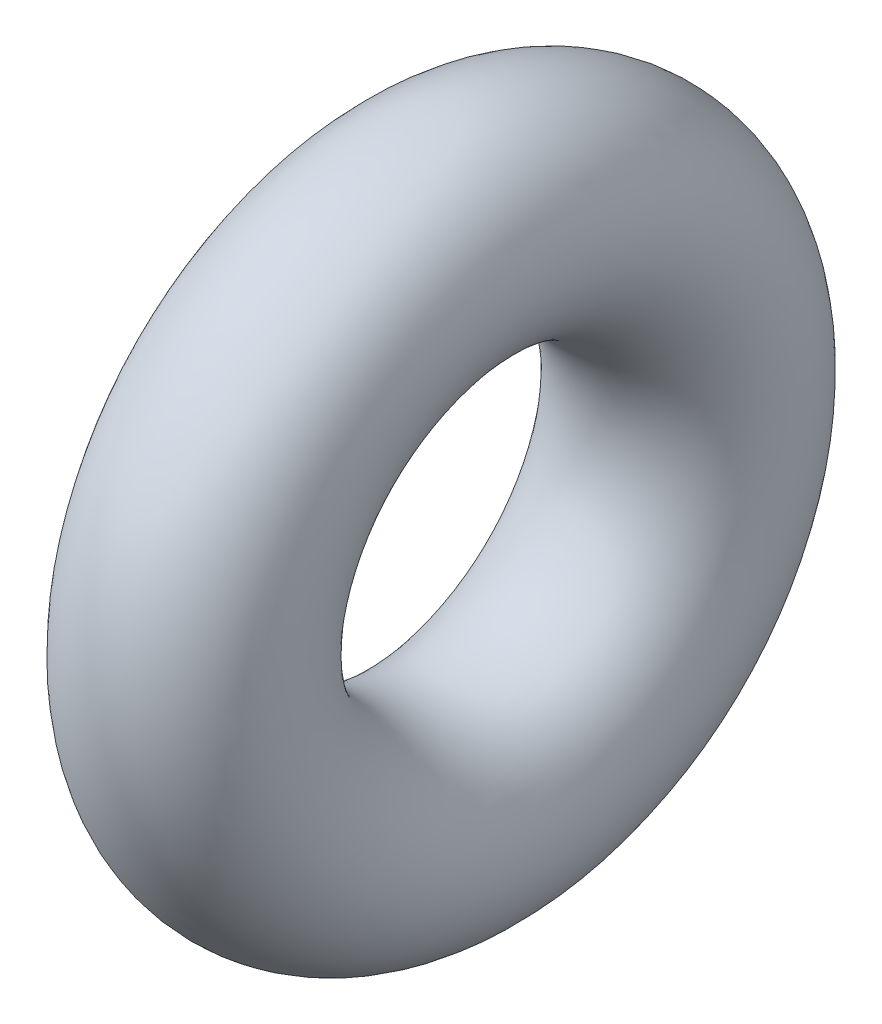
from build123d import *

# Parameters (mm, degrees)
ESQUISSE1_R = 0.8


with BuildPart() as part:
    # Esquisse1 → R_volution1 (revolve)
    with BuildSketch(Plane.XY, mode=Mode.PRIVATE) as r_volution1_sk:
        with Locations((7.1, 7.444912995)):
            Circle(ESQUISSE1_R)
    revolve(r_volution1_sk.sketch.rotate(Axis((0.4, 5.544912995, 0), (1, 0, 0)), 90), axis=Axis((0.4, 5.544912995, 0), (1, 0, 0)))


solid = part.part
